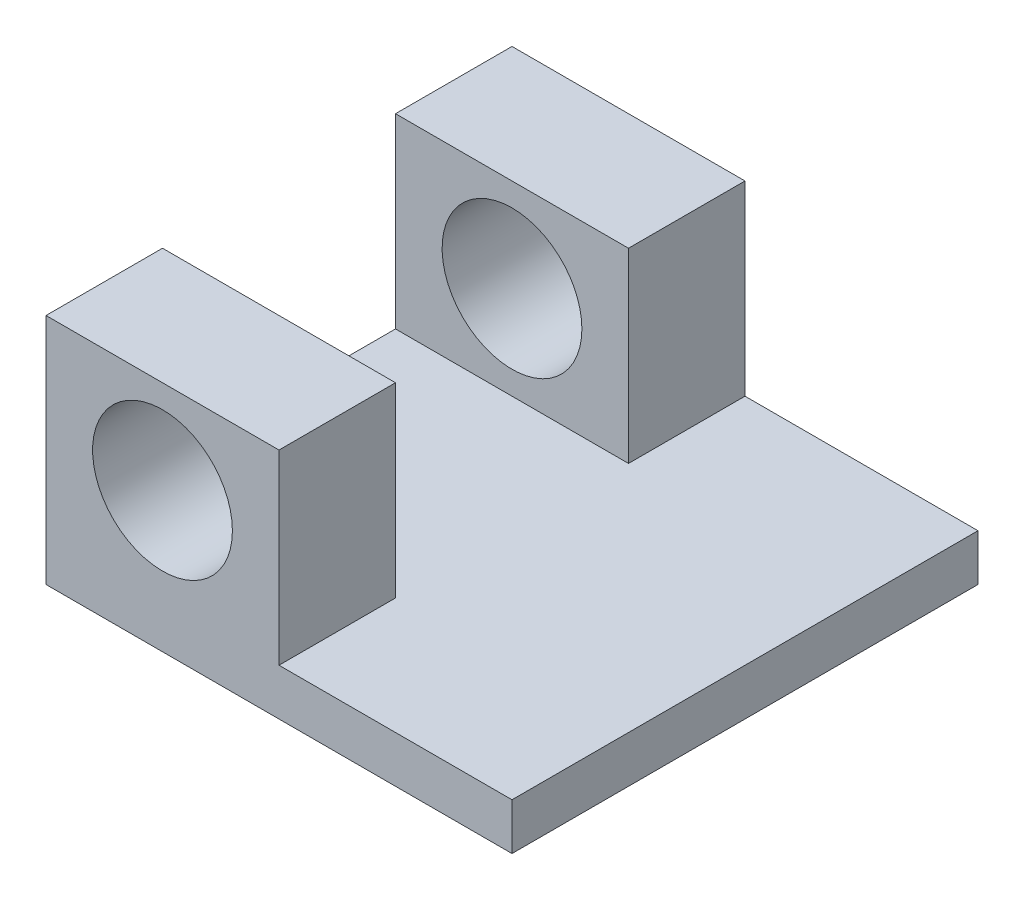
ISO-10303-21;
HEADER;
FILE_DESCRIPTION(('STEP AP214'),'2;1');
FILE_NAME('part.step','',(''),(''),'','','');
FILE_SCHEMA(('AUTOMOTIVE_DESIGN { 1 0 10303 214 1 1 1 1 }'));
ENDSEC;
DATA;
#1=APPLICATION_CONTEXT('core data for automotive mechanical design processes');
#2=APPLICATION_PROTOCOL_DEFINITION('international standard','automotive_design',2000,#1);
#3=PRODUCT_CONTEXT('',#1,'mechanical');
#4=PRODUCT('Part','Part','',(#3));
#5=PRODUCT_RELATED_PRODUCT_CATEGORY('part','',(#4));
#6=PRODUCT_DEFINITION_FORMATION('','',#4);
#7=PRODUCT_DEFINITION_CONTEXT('part definition',#1,'design');
#8=PRODUCT_DEFINITION('design','',#6,#7);
#9=PRODUCT_DEFINITION_SHAPE('','',#8);
#10=(LENGTH_UNIT() NAMED_UNIT(*) SI_UNIT(.MILLI.,.METRE.));
#11=(NAMED_UNIT(*) PLANE_ANGLE_UNIT() SI_UNIT($,.RADIAN.));
#12=(NAMED_UNIT(*) SI_UNIT($,.STERADIAN.) SOLID_ANGLE_UNIT());
#13=UNCERTAINTY_MEASURE_WITH_UNIT(LENGTH_MEASURE(1.E-05),#10,'distance_accuracy_value','');
#14=(GEOMETRIC_REPRESENTATION_CONTEXT(3) GLOBAL_UNCERTAINTY_ASSIGNED_CONTEXT((#13)) GLOBAL_UNIT_ASSIGNED_CONTEXT((#10,
#11,#12)) REPRESENTATION_CONTEXT('',''));
#15=CARTESIAN_POINT('',(0.,0.,0.));
#16=DIRECTION('',(0.,0.,1.));
#17=DIRECTION('',(1.,0.,0.));
#18=AXIS2_PLACEMENT_3D('',#15,#16,#17);
#19=CARTESIAN_POINT('',(0.,1.27,2.54));
#20=DIRECTION('',(0.,-1.,0.));
#21=DIRECTION('',(0.,0.,-1.));
#22=AXIS2_PLACEMENT_3D('',#19,#20,#21);
#23=PLANE('',#22);
#24=DIRECTION('',(0.,0.,-1.));
#25=VECTOR('',#24,1.);
#26=CARTESIAN_POINT('',(1.27,1.27,10.4775));
#27=LINE('',#26,#25);
#28=CARTESIAN_POINT('',(1.27,1.27,2.54));
#29=VERTEX_POINT('',#28);
#30=CARTESIAN_POINT('',(1.27,1.27,1.905));
#31=VERTEX_POINT('',#30);
#32=EDGE_CURVE('E154',#29,#31,#27,.T.);
#33=ORIENTED_EDGE('',*,*,#32,.T.);
#34=DIRECTION('',(1.,0.,0.));
#35=VECTOR('',#34,1.);
#36=CARTESIAN_POINT('',(-7.9375,1.27,1.905));
#37=LINE('',#36,#35);
#38=CARTESIAN_POINT('',(0.,1.27,1.905));
#39=VERTEX_POINT('',#38);
#40=EDGE_CURVE('E138',#39,#31,#37,.T.);
#41=ORIENTED_EDGE('',*,*,#40,.F.);
#42=DIRECTION('',(0.,0.,-1.));
#43=VECTOR('',#42,1.);
#44=CARTESIAN_POINT('',(0.,1.27,2.54));
#45=LINE('',#44,#43);
#46=CARTESIAN_POINT('',(0.,1.27,2.54));
#47=VERTEX_POINT('',#46);
#48=EDGE_CURVE('E183',#47,#39,#45,.T.);
#49=ORIENTED_EDGE('',*,*,#48,.F.);
#50=DIRECTION('',(-1.,0.,0.));
#51=VECTOR('',#50,1.);
#52=CARTESIAN_POINT('',(0.,1.27,2.54));
#53=LINE('',#52,#51);
#54=EDGE_CURVE('E171',#29,#47,#53,.T.);
#55=ORIENTED_EDGE('',*,*,#54,.F.);
#56=EDGE_LOOP('',(#33,#41,#49,#55));
#57=FACE_BOUND('',#56,.T.);
#58=ADVANCED_FACE('F31',(#57),#23,.F.);
#59=CARTESIAN_POINT('',(1.27,1.27,10.4775));
#60=DIRECTION('',(1.,0.,0.));
#61=DIRECTION('',(0.,0.,-1.));
#62=AXIS2_PLACEMENT_3D('',#59,#60,#61);
#63=PLANE('',#62);
#64=DIRECTION('',(0.,-1.,0.));
#65=VECTOR('',#64,1.);
#66=CARTESIAN_POINT('',(1.27,1.27,1.905));
#67=LINE('',#66,#65);
#68=CARTESIAN_POINT('',(1.27,0.254,1.905));
#69=VERTEX_POINT('',#68);
#70=EDGE_CURVE('E142',#31,#69,#67,.T.);
#71=ORIENTED_EDGE('',*,*,#70,.F.);
#72=ORIENTED_EDGE('',*,*,#32,.F.);
#73=DIRECTION('',(0.,-1.,0.));
#74=VECTOR('',#73,1.);
#75=CARTESIAN_POINT('',(1.27,1.27,2.54));
#76=LINE('',#75,#74);
#77=CARTESIAN_POINT('',(1.27,0.254,2.54));
#78=VERTEX_POINT('',#77);
#79=EDGE_CURVE('E159',#29,#78,#76,.T.);
#80=ORIENTED_EDGE('',*,*,#79,.T.);
#81=DIRECTION('',(0.,0.,-1.));
#82=VECTOR('',#81,1.);
#83=CARTESIAN_POINT('',(1.27,0.254,10.4775));
#84=LINE('',#83,#82);
#85=EDGE_CURVE('E117',#78,#69,#84,.T.);
#86=ORIENTED_EDGE('',*,*,#85,.T.);
#87=EDGE_LOOP('',(#71,#72,#80,#86));
#88=FACE_BOUND('',#87,.T.);
#89=ADVANCED_FACE('F206',(#88),#63,.T.);
#90=CARTESIAN_POINT('',(0.635,0.762,0.));
#91=DIRECTION('',(0.,0.,1.));
#92=DIRECTION('',(1.,0.,0.));
#93=AXIS2_PLACEMENT_3D('',#90,#91,#92);
#94=CYLINDRICAL_SURFACE('',#93,0.381000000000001);
#95=CARTESIAN_POINT('',(0.635,0.762,1.905));
#96=DIRECTION('',(0.,0.,1.));
#97=DIRECTION('',(0.,-1.,0.));
#98=AXIS2_PLACEMENT_3D('',#95,#96,#97);
#99=CIRCLE('',#98,0.381000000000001);
#100=CARTESIAN_POINT('',(0.635,0.380999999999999,1.905));
#101=VERTEX_POINT('',#100);
#102=EDGE_CURVE('E35',#101,#101,#99,.F.);
#103=ORIENTED_EDGE('',*,*,#102,.T.);
#104=EDGE_LOOP('',(#103));
#105=FACE_BOUND('',#104,.T.);
#106=CARTESIAN_POINT('',(0.635,0.762,2.54));
#107=DIRECTION('',(0.,0.,1.));
#108=DIRECTION('',(1.,0.,0.));
#109=AXIS2_PLACEMENT_3D('',#106,#107,#108);
#110=CIRCLE('',#109,0.381000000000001);
#111=CARTESIAN_POINT('',(1.016,0.762,2.54));
#112=VERTEX_POINT('',#111);
#113=EDGE_CURVE('E147',#112,#112,#110,.T.);
#114=ORIENTED_EDGE('',*,*,#113,.T.);
#115=EDGE_LOOP('',(#114));
#116=FACE_BOUND('',#115,.T.);
#117=ADVANCED_FACE('F213',(#105,#116),#94,.F.);
#118=CARTESIAN_POINT('',(2.54,0.,2.54));
#119=DIRECTION('',(-1.,0.,0.));
#120=DIRECTION('',(0.,0.,1.));
#121=AXIS2_PLACEMENT_3D('',#118,#119,#120);
#122=PLANE('',#121);
#123=DIRECTION('',(0.,0.,-1.));
#124=VECTOR('',#123,1.);
#125=CARTESIAN_POINT('',(2.54,0.254,10.4775));
#126=LINE('',#125,#124);
#127=CARTESIAN_POINT('',(2.54,0.254,2.54));
#128=VERTEX_POINT('',#127);
#129=CARTESIAN_POINT('',(2.54,0.254,0.));
#130=VERTEX_POINT('',#129);
#131=EDGE_CURVE('E152',#128,#130,#126,.T.);
#132=ORIENTED_EDGE('',*,*,#131,.F.);
#133=DIRECTION('',(0.,1.,0.));
#134=VECTOR('',#133,1.);
#135=CARTESIAN_POINT('',(2.54,0.,2.54));
#136=LINE('',#135,#134);
#137=CARTESIAN_POINT('',(2.54,0.,2.54));
#138=VERTEX_POINT('',#137);
#139=EDGE_CURVE('E168',#138,#128,#136,.T.);
#140=ORIENTED_EDGE('',*,*,#139,.F.);
#141=DIRECTION('',(0.,0.,-1.));
#142=VECTOR('',#141,1.);
#143=CARTESIAN_POINT('',(2.54,0.,2.54));
#144=LINE('',#143,#142);
#145=CARTESIAN_POINT('',(2.54,0.,0.));
#146=VERTEX_POINT('',#145);
#147=EDGE_CURVE('E185',#138,#146,#144,.T.);
#148=ORIENTED_EDGE('',*,*,#147,.T.);
#149=DIRECTION('',(0.,1.,0.));
#150=VECTOR('',#149,1.);
#151=CARTESIAN_POINT('',(2.54,0.,0.));
#152=LINE('',#151,#150);
#153=EDGE_CURVE('E178',#146,#130,#152,.T.);
#154=ORIENTED_EDGE('',*,*,#153,.T.);
#155=EDGE_LOOP('',(#132,#140,#148,#154));
#156=FACE_BOUND('',#155,.T.);
#157=ADVANCED_FACE('F220',(#156),#122,.F.);
#158=CARTESIAN_POINT('',(0.,1.27,0.635));
#159=VERTEX_POINT('',#158);
#160=CARTESIAN_POINT('',(0.,1.27,0.));
#161=VERTEX_POINT('',#160);
#162=EDGE_CURVE('E173',#159,#161,#45,.T.);
#163=ORIENTED_EDGE('',*,*,#162,.F.);
#164=DIRECTION('',(1.,0.,0.));
#165=VECTOR('',#164,1.);
#166=CARTESIAN_POINT('',(-7.9375,1.27,0.635));
#167=LINE('',#166,#165);
#168=CARTESIAN_POINT('',(1.27,1.27,0.635));
#169=VERTEX_POINT('',#168);
#170=EDGE_CURVE('E131',#159,#169,#167,.T.);
#171=ORIENTED_EDGE('',*,*,#170,.T.);
#172=CARTESIAN_POINT('',(1.27,1.27,0.));
#173=VERTEX_POINT('',#172);
#174=EDGE_CURVE('E124',#169,#173,#27,.T.);
#175=ORIENTED_EDGE('',*,*,#174,.T.);
#176=DIRECTION('',(-1.,0.,0.));
#177=VECTOR('',#176,1.);
#178=CARTESIAN_POINT('',(0.,1.27,0.));
#179=LINE('',#178,#177);
#180=EDGE_CURVE('E166',#173,#161,#179,.T.);
#181=ORIENTED_EDGE('',*,*,#180,.T.);
#182=EDGE_LOOP('',(#163,#171,#175,#181));
#183=FACE_BOUND('',#182,.T.);
#184=ADVANCED_FACE('F209',(#183),#23,.F.);
#185=CARTESIAN_POINT('',(0.,1.27,2.54));
#186=DIRECTION('',(0.,0.,-1.));
#187=DIRECTION('',(-1.,0.,0.));
#188=AXIS2_PLACEMENT_3D('',#185,#186,#187);
#189=PLANE('',#188);
#190=ORIENTED_EDGE('',*,*,#113,.F.);
#191=EDGE_LOOP('',(#190));
#192=FACE_BOUND('',#191,.T.);
#193=ORIENTED_EDGE('',*,*,#79,.F.);
#194=ORIENTED_EDGE('',*,*,#54,.T.);
#195=DIRECTION('',(0.,-1.,0.));
#196=VECTOR('',#195,1.);
#197=CARTESIAN_POINT('',(0.,0.,2.54));
#198=LINE('',#197,#196);
#199=CARTESIAN_POINT('',(0.,0.,2.54));
#200=VERTEX_POINT('',#199);
#201=EDGE_CURVE('E162',#47,#200,#198,.T.);
#202=ORIENTED_EDGE('',*,*,#201,.T.);
#203=DIRECTION('',(1.,0.,0.));
#204=VECTOR('',#203,1.);
#205=CARTESIAN_POINT('',(0.,0.,2.54));
#206=LINE('',#205,#204);
#207=EDGE_CURVE('E165',#200,#138,#206,.T.);
#208=ORIENTED_EDGE('',*,*,#207,.T.);
#209=ORIENTED_EDGE('',*,*,#139,.T.);
#210=DIRECTION('',(1.,0.,0.));
#211=VECTOR('',#210,1.);
#212=CARTESIAN_POINT('',(0.,0.254,2.54));
#213=LINE('',#212,#211);
#214=EDGE_CURVE('E157',#78,#128,#213,.T.);
#215=ORIENTED_EDGE('',*,*,#214,.F.);
#216=EDGE_LOOP('',(#193,#194,#202,#208,#209,#215));
#217=FACE_BOUND('',#216,.T.);
#218=ADVANCED_FACE('F219',(#192,#217),#189,.F.);
#219=CARTESIAN_POINT('',(0.,1.27,0.));
#220=DIRECTION('',(0.,0.,-1.));
#221=DIRECTION('',(-1.,0.,0.));
#222=AXIS2_PLACEMENT_3D('',#219,#220,#221);
#223=PLANE('',#222);
#224=CARTESIAN_POINT('',(0.635,0.762,0.));
#225=DIRECTION('',(0.,0.,1.));
#226=DIRECTION('',(1.,0.,0.));
#227=AXIS2_PLACEMENT_3D('',#224,#225,#226);
#228=CIRCLE('',#227,0.381000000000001);
#229=CARTESIAN_POINT('',(1.016,0.762,0.));
#230=VERTEX_POINT('',#229);
#231=EDGE_CURVE('E118',#230,#230,#228,.T.);
#232=ORIENTED_EDGE('',*,*,#231,.T.);
#233=EDGE_LOOP('',(#232));
#234=FACE_BOUND('',#233,.T.);
#235=ORIENTED_EDGE('',*,*,#180,.F.);
#236=DIRECTION('',(0.,-1.,0.));
#237=VECTOR('',#236,1.);
#238=CARTESIAN_POINT('',(1.27,1.27,0.));
#239=LINE('',#238,#237);
#240=CARTESIAN_POINT('',(1.27,0.254,0.));
#241=VERTEX_POINT('',#240);
#242=EDGE_CURVE('E11',#173,#241,#239,.T.);
#243=ORIENTED_EDGE('',*,*,#242,.T.);
#244=DIRECTION('',(1.,0.,0.));
#245=VECTOR('',#244,1.);
#246=CARTESIAN_POINT('',(0.,0.254,0.));
#247=LINE('',#246,#245);
#248=EDGE_CURVE('E40',#241,#130,#247,.T.);
#249=ORIENTED_EDGE('',*,*,#248,.T.);
#250=ORIENTED_EDGE('',*,*,#153,.F.);
#251=DIRECTION('',(1.,0.,0.));
#252=VECTOR('',#251,1.);
#253=CARTESIAN_POINT('',(0.,0.,0.));
#254=LINE('',#253,#252);
#255=CARTESIAN_POINT('',(0.,0.,0.));
#256=VERTEX_POINT('',#255);
#257=EDGE_CURVE('E176',#256,#146,#254,.T.);
#258=ORIENTED_EDGE('',*,*,#257,.F.);
#259=DIRECTION('',(0.,-1.,0.));
#260=VECTOR('',#259,1.);
#261=CARTESIAN_POINT('',(0.,0.,0.));
#262=LINE('',#261,#260);
#263=EDGE_CURVE('E161',#161,#256,#262,.T.);
#264=ORIENTED_EDGE('',*,*,#263,.F.);
#265=EDGE_LOOP('',(#235,#243,#249,#250,#258,#264));
#266=FACE_BOUND('',#265,.T.);
#267=ADVANCED_FACE('F226',(#234,#266),#223,.T.);
#268=CARTESIAN_POINT('',(0.,0.,2.54));
#269=DIRECTION('',(1.,0.,0.));
#270=DIRECTION('',(0.,0.,-1.));
#271=AXIS2_PLACEMENT_3D('',#268,#269,#270);
#272=PLANE('',#271);
#273=ORIENTED_EDGE('',*,*,#48,.T.);
#274=DIRECTION('',(0.,-1.,0.));
#275=VECTOR('',#274,1.);
#276=CARTESIAN_POINT('',(0.,0.,1.905));
#277=LINE('',#276,#275);
#278=CARTESIAN_POINT('',(0.,0.254,1.905));
#279=VERTEX_POINT('',#278);
#280=EDGE_CURVE('E48',#39,#279,#277,.T.);
#281=ORIENTED_EDGE('',*,*,#280,.T.);
#282=DIRECTION('',(0.,0.,-1.));
#283=VECTOR('',#282,1.);
#284=CARTESIAN_POINT('',(0.,0.254,2.54));
#285=LINE('',#284,#283);
#286=CARTESIAN_POINT('',(0.,0.254,0.635));
#287=VERTEX_POINT('',#286);
#288=EDGE_CURVE('E52',#279,#287,#285,.T.);
#289=ORIENTED_EDGE('',*,*,#288,.T.);
#290=DIRECTION('',(0.,1.,0.));
#291=VECTOR('',#290,1.);
#292=CARTESIAN_POINT('',(0.,0.,0.635));
#293=LINE('',#292,#291);
#294=EDGE_CURVE('E127',#287,#159,#293,.T.);
#295=ORIENTED_EDGE('',*,*,#294,.T.);
#296=ORIENTED_EDGE('',*,*,#162,.T.);
#297=ORIENTED_EDGE('',*,*,#263,.T.);
#298=DIRECTION('',(0.,0.,-1.));
#299=VECTOR('',#298,1.);
#300=CARTESIAN_POINT('',(0.,0.,2.54));
#301=LINE('',#300,#299);
#302=EDGE_CURVE('E188',#200,#256,#301,.T.);
#303=ORIENTED_EDGE('',*,*,#302,.F.);
#304=ORIENTED_EDGE('',*,*,#201,.F.);
#305=EDGE_LOOP('',(#273,#281,#289,#295,#296,#297,#303,#304));
#306=FACE_BOUND('',#305,.T.);
#307=ADVANCED_FACE('F33',(#306),#272,.F.);
#308=CARTESIAN_POINT('',(0.,0.,2.54));
#309=DIRECTION('',(0.,1.,0.));
#310=DIRECTION('',(0.,0.,1.));
#311=AXIS2_PLACEMENT_3D('',#308,#309,#310);
#312=PLANE('',#311);
#313=ORIENTED_EDGE('',*,*,#257,.T.);
#314=ORIENTED_EDGE('',*,*,#147,.F.);
#315=ORIENTED_EDGE('',*,*,#207,.F.);
#316=ORIENTED_EDGE('',*,*,#302,.T.);
#317=EDGE_LOOP('',(#313,#314,#315,#316));
#318=FACE_BOUND('',#317,.T.);
#319=ADVANCED_FACE('F239',(#318),#312,.F.);
#320=DIRECTION('',(0.,1.,0.));
#321=VECTOR('',#320,1.);
#322=CARTESIAN_POINT('',(1.27,1.27,0.635));
#323=LINE('',#322,#321);
#324=CARTESIAN_POINT('',(1.27,0.254,0.635));
#325=VERTEX_POINT('',#324);
#326=EDGE_CURVE('E122',#325,#169,#323,.T.);
#327=ORIENTED_EDGE('',*,*,#326,.F.);
#328=EDGE_CURVE('E109',#325,#241,#84,.T.);
#329=ORIENTED_EDGE('',*,*,#328,.T.);
#330=ORIENTED_EDGE('',*,*,#242,.F.);
#331=ORIENTED_EDGE('',*,*,#174,.F.);
#332=EDGE_LOOP('',(#327,#329,#330,#331));
#333=FACE_BOUND('',#332,.T.);
#334=ADVANCED_FACE('F123',(#333),#63,.T.);
#335=CARTESIAN_POINT('',(1.27,0.254,10.4775));
#336=DIRECTION('',(0.,1.,0.));
#337=DIRECTION('',(0.,0.,1.));
#338=AXIS2_PLACEMENT_3D('',#335,#336,#337);
#339=PLANE('',#338);
#340=ORIENTED_EDGE('',*,*,#328,.F.);
#341=DIRECTION('',(1.,0.,0.));
#342=VECTOR('',#341,1.);
#343=CARTESIAN_POINT('',(-7.9375,0.254,0.635));
#344=LINE('',#343,#342);
#345=EDGE_CURVE('E113',#287,#325,#344,.T.);
#346=ORIENTED_EDGE('',*,*,#345,.F.);
#347=ORIENTED_EDGE('',*,*,#288,.F.);
#348=DIRECTION('',(1.,0.,0.));
#349=VECTOR('',#348,1.);
#350=CARTESIAN_POINT('',(-7.9375,0.254,1.905));
#351=LINE('',#350,#349);
#352=EDGE_CURVE('E133',#279,#69,#351,.T.);
#353=ORIENTED_EDGE('',*,*,#352,.T.);
#354=ORIENTED_EDGE('',*,*,#85,.F.);
#355=ORIENTED_EDGE('',*,*,#214,.T.);
#356=ORIENTED_EDGE('',*,*,#131,.T.);
#357=ORIENTED_EDGE('',*,*,#248,.F.);
#358=EDGE_LOOP('',(#340,#346,#347,#353,#354,#355,#356,#357));
#359=FACE_BOUND('',#358,.T.);
#360=ADVANCED_FACE('F111',(#359),#339,.T.);
#361=CARTESIAN_POINT('',(0.635,0.762,0.635));
#362=DIRECTION('',(0.,0.,-1.));
#363=DIRECTION('',(0.,1.,0.));
#364=AXIS2_PLACEMENT_3D('',#361,#362,#363);
#365=CIRCLE('',#364,0.381000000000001);
#366=CARTESIAN_POINT('',(0.635,1.143,0.635));
#367=VERTEX_POINT('',#366);
#368=EDGE_CURVE('E128',#367,#367,#365,.F.);
#369=ORIENTED_EDGE('',*,*,#368,.T.);
#370=EDGE_LOOP('',(#369));
#371=FACE_BOUND('',#370,.T.);
#372=ORIENTED_EDGE('',*,*,#231,.F.);
#373=EDGE_LOOP('',(#372));
#374=FACE_BOUND('',#373,.T.);
#375=ADVANCED_FACE('F194',(#371,#374),#94,.F.);
#376=CARTESIAN_POINT('',(-7.9375,1.27,1.905));
#377=DIRECTION('',(0.,0.,1.));
#378=DIRECTION('',(0.,-1.,0.));
#379=AXIS2_PLACEMENT_3D('',#376,#377,#378);
#380=PLANE('',#379);
#381=ORIENTED_EDGE('',*,*,#102,.F.);
#382=EDGE_LOOP('',(#381));
#383=FACE_BOUND('',#382,.T.);
#384=ORIENTED_EDGE('',*,*,#280,.F.);
#385=ORIENTED_EDGE('',*,*,#40,.T.);
#386=ORIENTED_EDGE('',*,*,#70,.T.);
#387=ORIENTED_EDGE('',*,*,#352,.F.);
#388=EDGE_LOOP('',(#384,#385,#386,#387));
#389=FACE_BOUND('',#388,.T.);
#390=ADVANCED_FACE('F198',(#383,#389),#380,.F.);
#391=CARTESIAN_POINT('',(-7.9375,0.254,0.635));
#392=DIRECTION('',(0.,0.,-1.));
#393=DIRECTION('',(0.,1.,0.));
#394=AXIS2_PLACEMENT_3D('',#391,#392,#393);
#395=PLANE('',#394);
#396=ORIENTED_EDGE('',*,*,#368,.F.);
#397=EDGE_LOOP('',(#396));
#398=FACE_BOUND('',#397,.T.);
#399=ORIENTED_EDGE('',*,*,#294,.F.);
#400=ORIENTED_EDGE('',*,*,#345,.T.);
#401=ORIENTED_EDGE('',*,*,#326,.T.);
#402=ORIENTED_EDGE('',*,*,#170,.F.);
#403=EDGE_LOOP('',(#399,#400,#401,#402));
#404=FACE_BOUND('',#403,.T.);
#405=ADVANCED_FACE('F130',(#398,#404),#395,.F.);
#406=CLOSED_SHELL('',(#58,#89,#117,#157,#184,#218,#267,#307,#319,#334,#360,#375,#390,#405));
#407=MANIFOLD_SOLID_BREP('B2',#406);
#408=ADVANCED_BREP_SHAPE_REPRESENTATION('',(#18,#407),#14);
#409=SHAPE_DEFINITION_REPRESENTATION(#9,#408);
ENDSEC;
END-ISO-10303-21;
